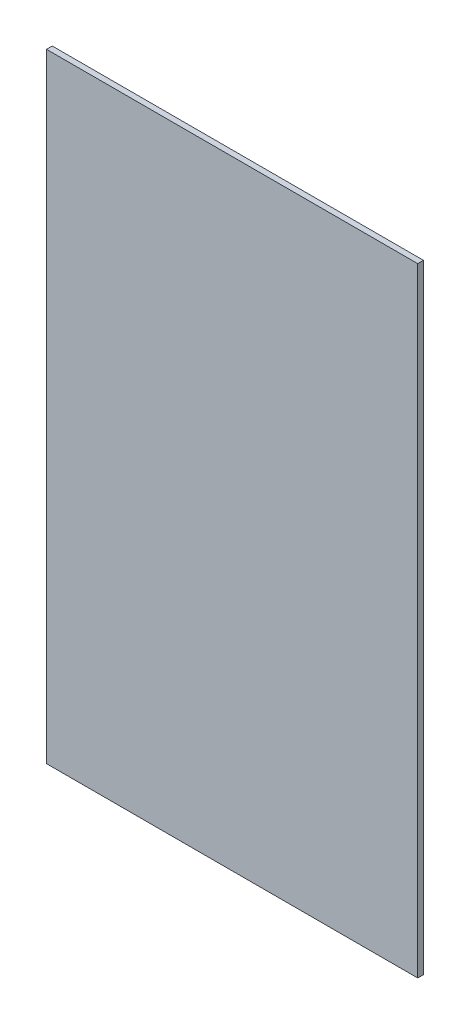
ISO-10303-21;
HEADER;
FILE_DESCRIPTION(('STEP AP214'),'2;1');
FILE_NAME('part.step','',(''),(''),'','','');
FILE_SCHEMA(('AUTOMOTIVE_DESIGN { 1 0 10303 214 1 1 1 1 }'));
ENDSEC;
DATA;
#1=APPLICATION_CONTEXT('core data for automotive mechanical design processes');
#2=APPLICATION_PROTOCOL_DEFINITION('international standard','automotive_design',2000,#1);
#3=PRODUCT_CONTEXT('',#1,'mechanical');
#4=PRODUCT('Part','Part','',(#3));
#5=PRODUCT_RELATED_PRODUCT_CATEGORY('part','',(#4));
#6=PRODUCT_DEFINITION_FORMATION('','',#4);
#7=PRODUCT_DEFINITION_CONTEXT('part definition',#1,'design');
#8=PRODUCT_DEFINITION('design','',#6,#7);
#9=PRODUCT_DEFINITION_SHAPE('','',#8);
#10=(LENGTH_UNIT() NAMED_UNIT(*) SI_UNIT(.MILLI.,.METRE.));
#11=(NAMED_UNIT(*) PLANE_ANGLE_UNIT() SI_UNIT($,.RADIAN.));
#12=(NAMED_UNIT(*) SI_UNIT($,.STERADIAN.) SOLID_ANGLE_UNIT());
#13=UNCERTAINTY_MEASURE_WITH_UNIT(LENGTH_MEASURE(1.E-05),#10,'distance_accuracy_value','');
#14=(GEOMETRIC_REPRESENTATION_CONTEXT(3) GLOBAL_UNCERTAINTY_ASSIGNED_CONTEXT((#13)) GLOBAL_UNIT_ASSIGNED_CONTEXT((#10,
#11,#12)) REPRESENTATION_CONTEXT('',''));
#15=CARTESIAN_POINT('',(0.,0.,0.));
#16=DIRECTION('',(0.,0.,1.));
#17=DIRECTION('',(1.,0.,0.));
#18=AXIS2_PLACEMENT_3D('',#15,#16,#17);
#19=CARTESIAN_POINT('',(76.2,-127.,2.3622));
#20=DIRECTION('',(-1.,0.,0.));
#21=DIRECTION('',(0.,0.,1.));
#22=AXIS2_PLACEMENT_3D('',#19,#20,#21);
#23=PLANE('',#22);
#24=DIRECTION('',(0.,1.,0.));
#25=VECTOR('',#24,1.);
#26=CARTESIAN_POINT('',(76.2,-127.,0.));
#27=LINE('',#26,#25);
#28=CARTESIAN_POINT('',(76.2,-127.,0.));
#29=VERTEX_POINT('',#28);
#30=CARTESIAN_POINT('',(76.2,127.,0.));
#31=VERTEX_POINT('',#30);
#32=EDGE_CURVE('E104',#29,#31,#27,.T.);
#33=ORIENTED_EDGE('',*,*,#32,.T.);
#34=DIRECTION('',(0.,0.,-1.));
#35=VECTOR('',#34,1.);
#36=CARTESIAN_POINT('',(76.2,127.,2.3622));
#37=LINE('',#36,#35);
#38=CARTESIAN_POINT('',(76.2,127.,2.3622));
#39=VERTEX_POINT('',#38);
#40=EDGE_CURVE('E11',#39,#31,#37,.T.);
#41=ORIENTED_EDGE('',*,*,#40,.F.);
#42=DIRECTION('',(0.,1.,0.));
#43=VECTOR('',#42,1.);
#44=CARTESIAN_POINT('',(76.2,-127.,2.3622));
#45=LINE('',#44,#43);
#46=CARTESIAN_POINT('',(76.2,-127.,2.3622));
#47=VERTEX_POINT('',#46);
#48=EDGE_CURVE('E91',#47,#39,#45,.T.);
#49=ORIENTED_EDGE('',*,*,#48,.F.);
#50=DIRECTION('',(0.,0.,-1.));
#51=VECTOR('',#50,1.);
#52=CARTESIAN_POINT('',(76.2,-127.,2.3622));
#53=LINE('',#52,#51);
#54=EDGE_CURVE('E100',#47,#29,#53,.T.);
#55=ORIENTED_EDGE('',*,*,#54,.T.);
#56=EDGE_LOOP('',(#33,#41,#49,#55));
#57=FACE_BOUND('',#56,.T.);
#58=ADVANCED_FACE('F40',(#57),#23,.F.);
#59=CARTESIAN_POINT('',(-76.2,127.,2.3622));
#60=DIRECTION('',(0.,-1.,0.));
#61=DIRECTION('',(0.,0.,-1.));
#62=AXIS2_PLACEMENT_3D('',#59,#60,#61);
#63=PLANE('',#62);
#64=DIRECTION('',(-1.,0.,0.));
#65=VECTOR('',#64,1.);
#66=CARTESIAN_POINT('',(-76.2,127.,0.));
#67=LINE('',#66,#65);
#68=CARTESIAN_POINT('',(-76.2,127.,0.));
#69=VERTEX_POINT('',#68);
#70=EDGE_CURVE('E96',#31,#69,#67,.T.);
#71=ORIENTED_EDGE('',*,*,#70,.T.);
#72=DIRECTION('',(0.,0.,-1.));
#73=VECTOR('',#72,1.);
#74=CARTESIAN_POINT('',(-76.2,127.,2.3622));
#75=LINE('',#74,#73);
#76=CARTESIAN_POINT('',(-76.2,127.,2.3622));
#77=VERTEX_POINT('',#76);
#78=EDGE_CURVE('E48',#77,#69,#75,.T.);
#79=ORIENTED_EDGE('',*,*,#78,.F.);
#80=DIRECTION('',(-1.,0.,0.));
#81=VECTOR('',#80,1.);
#82=CARTESIAN_POINT('',(-76.2,127.,2.3622));
#83=LINE('',#82,#81);
#84=EDGE_CURVE('E86',#39,#77,#83,.T.);
#85=ORIENTED_EDGE('',*,*,#84,.F.);
#86=ORIENTED_EDGE('',*,*,#40,.T.);
#87=EDGE_LOOP('',(#71,#79,#85,#86));
#88=FACE_BOUND('',#87,.T.);
#89=ADVANCED_FACE('F95',(#88),#63,.F.);
#90=CARTESIAN_POINT('',(-76.2,-127.,2.3622));
#91=DIRECTION('',(1.,0.,0.));
#92=DIRECTION('',(0.,0.,-1.));
#93=AXIS2_PLACEMENT_3D('',#90,#91,#92);
#94=PLANE('',#93);
#95=DIRECTION('',(0.,-1.,0.));
#96=VECTOR('',#95,1.);
#97=CARTESIAN_POINT('',(-76.2,-127.,0.));
#98=LINE('',#97,#96);
#99=CARTESIAN_POINT('',(-76.2,-127.,0.));
#100=VERTEX_POINT('',#99);
#101=EDGE_CURVE('E73',#69,#100,#98,.T.);
#102=ORIENTED_EDGE('',*,*,#101,.T.);
#103=DIRECTION('',(0.,0.,-1.));
#104=VECTOR('',#103,1.);
#105=CARTESIAN_POINT('',(-76.2,-127.,2.3622));
#106=LINE('',#105,#104);
#107=CARTESIAN_POINT('',(-76.2,-127.,2.3622));
#108=VERTEX_POINT('',#107);
#109=EDGE_CURVE('E97',#108,#100,#106,.T.);
#110=ORIENTED_EDGE('',*,*,#109,.F.);
#111=DIRECTION('',(0.,-1.,0.));
#112=VECTOR('',#111,1.);
#113=CARTESIAN_POINT('',(-76.2,-127.,2.3622));
#114=LINE('',#113,#112);
#115=EDGE_CURVE('E89',#77,#108,#114,.T.);
#116=ORIENTED_EDGE('',*,*,#115,.F.);
#117=ORIENTED_EDGE('',*,*,#78,.T.);
#118=EDGE_LOOP('',(#102,#110,#116,#117));
#119=FACE_BOUND('',#118,.T.);
#120=ADVANCED_FACE('F98',(#119),#94,.F.);
#121=CARTESIAN_POINT('',(-76.2,-127.,2.3622));
#122=DIRECTION('',(0.,1.,0.));
#123=DIRECTION('',(0.,0.,1.));
#124=AXIS2_PLACEMENT_3D('',#121,#122,#123);
#125=PLANE('',#124);
#126=DIRECTION('',(1.,0.,0.));
#127=VECTOR('',#126,1.);
#128=CARTESIAN_POINT('',(-76.2,-127.,0.));
#129=LINE('',#128,#127);
#130=EDGE_CURVE('E79',#100,#29,#129,.T.);
#131=ORIENTED_EDGE('',*,*,#130,.T.);
#132=ORIENTED_EDGE('',*,*,#54,.F.);
#133=DIRECTION('',(1.,0.,0.));
#134=VECTOR('',#133,1.);
#135=CARTESIAN_POINT('',(-76.2,-127.,2.3622));
#136=LINE('',#135,#134);
#137=EDGE_CURVE('E56',#108,#47,#136,.T.);
#138=ORIENTED_EDGE('',*,*,#137,.F.);
#139=ORIENTED_EDGE('',*,*,#109,.T.);
#140=EDGE_LOOP('',(#131,#132,#138,#139));
#141=FACE_BOUND('',#140,.T.);
#142=ADVANCED_FACE('F113',(#141),#125,.F.);
#143=CARTESIAN_POINT('',(0.,0.,2.3622));
#144=DIRECTION('',(0.,0.,-1.));
#145=DIRECTION('',(-1.,0.,0.));
#146=AXIS2_PLACEMENT_3D('',#143,#144,#145);
#147=PLANE('',#146);
#148=ORIENTED_EDGE('',*,*,#48,.T.);
#149=ORIENTED_EDGE('',*,*,#84,.T.);
#150=ORIENTED_EDGE('',*,*,#115,.T.);
#151=ORIENTED_EDGE('',*,*,#137,.T.);
#152=EDGE_LOOP('',(#148,#149,#150,#151));
#153=FACE_BOUND('',#152,.T.);
#154=ADVANCED_FACE('F87',(#153),#147,.F.);
#155=CARTESIAN_POINT('',(0.,0.,0.));
#156=DIRECTION('',(0.,0.,-1.));
#157=DIRECTION('',(-1.,0.,0.));
#158=AXIS2_PLACEMENT_3D('',#155,#156,#157);
#159=PLANE('',#158);
#160=ORIENTED_EDGE('',*,*,#32,.F.);
#161=ORIENTED_EDGE('',*,*,#130,.F.);
#162=ORIENTED_EDGE('',*,*,#101,.F.);
#163=ORIENTED_EDGE('',*,*,#70,.F.);
#164=EDGE_LOOP('',(#160,#161,#162,#163));
#165=FACE_BOUND('',#164,.T.);
#166=ADVANCED_FACE('F116',(#165),#159,.T.);
#167=CLOSED_SHELL('',(#58,#89,#120,#142,#154,#166));
#168=MANIFOLD_SOLID_BREP('B2',#167);
#169=ADVANCED_BREP_SHAPE_REPRESENTATION('',(#18,#168),#14);
#170=SHAPE_DEFINITION_REPRESENTATION(#9,#169);
ENDSEC;
END-ISO-10303-21;
